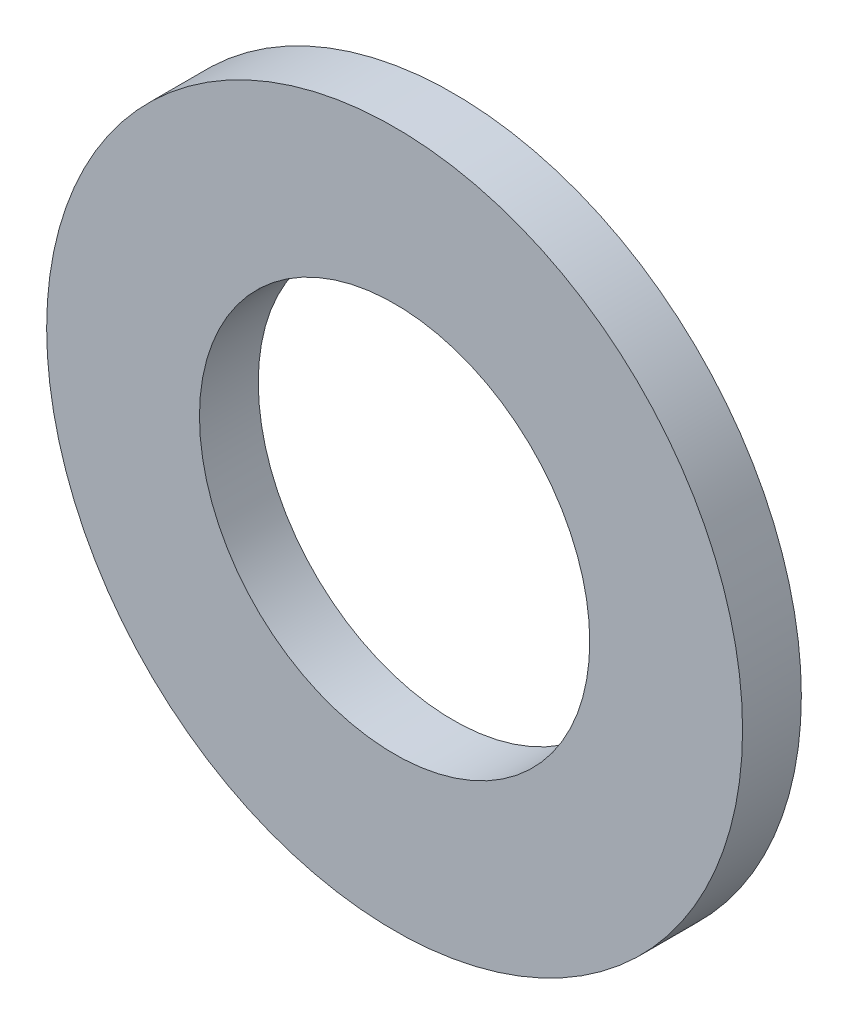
from build123d import *

# Parameters (mm, degrees)
SKETCH1_R          = 18.796
EXTRUDE1_DEPTH     = 3.175
SKETCH2_R          = 10.541
CUT_EXTRUDE1_DEPTH = 27.770503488


with BuildPart() as part:
    # Sketch1 → Extrude1 (new body)
    with BuildSketch(Plane.XY):
        Circle(SKETCH1_R)
    extrude(amount=EXTRUDE1_DEPTH)

    # Sketch2 → Cut-Extrude1 (cut, through all)
    with BuildSketch(Plane.XY.offset(3.175)):
        Circle(SKETCH2_R)
    extrude(amount=-CUT_EXTRUDE1_DEPTH, mode=Mode.SUBTRACT)


solid = part.part
